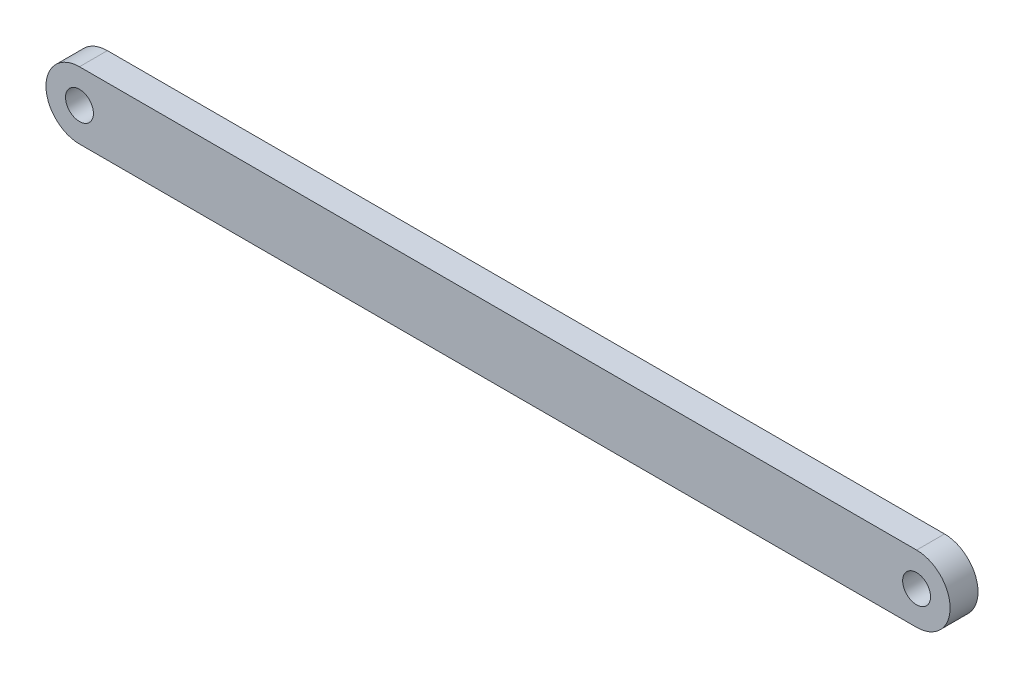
ISO-10303-21;
HEADER;
FILE_DESCRIPTION(('STEP AP214'),'2;1');
FILE_NAME('part.step','',(''),(''),'','','');
FILE_SCHEMA(('AUTOMOTIVE_DESIGN { 1 0 10303 214 1 1 1 1 }'));
ENDSEC;
DATA;
#1=APPLICATION_CONTEXT('core data for automotive mechanical design processes');
#2=APPLICATION_PROTOCOL_DEFINITION('international standard','automotive_design',2000,#1);
#3=PRODUCT_CONTEXT('',#1,'mechanical');
#4=PRODUCT('Part','Part','',(#3));
#5=PRODUCT_RELATED_PRODUCT_CATEGORY('part','',(#4));
#6=PRODUCT_DEFINITION_FORMATION('','',#4);
#7=PRODUCT_DEFINITION_CONTEXT('part definition',#1,'design');
#8=PRODUCT_DEFINITION('design','',#6,#7);
#9=PRODUCT_DEFINITION_SHAPE('','',#8);
#10=(LENGTH_UNIT() NAMED_UNIT(*) SI_UNIT(.MILLI.,.METRE.));
#11=(NAMED_UNIT(*) PLANE_ANGLE_UNIT() SI_UNIT($,.RADIAN.));
#12=(NAMED_UNIT(*) SI_UNIT($,.STERADIAN.) SOLID_ANGLE_UNIT());
#13=UNCERTAINTY_MEASURE_WITH_UNIT(LENGTH_MEASURE(1.E-05),#10,'distance_accuracy_value','');
#14=(GEOMETRIC_REPRESENTATION_CONTEXT(3) GLOBAL_UNCERTAINTY_ASSIGNED_CONTEXT((#13)) GLOBAL_UNIT_ASSIGNED_CONTEXT((#10,
#11,#12)) REPRESENTATION_CONTEXT('',''));
#15=CARTESIAN_POINT('',(0.,0.,0.));
#16=DIRECTION('',(0.,0.,1.));
#17=DIRECTION('',(1.,0.,0.));
#18=AXIS2_PLACEMENT_3D('',#15,#16,#17);
#19=CARTESIAN_POINT('',(-75.,0.,2.5));
#20=DIRECTION('',(0.,0.,1.));
#21=DIRECTION('',(1.,0.,0.));
#22=AXIS2_PLACEMENT_3D('',#19,#20,#21);
#23=PLANE('',#22);
#24=CARTESIAN_POINT('',(75.,0.,2.5));
#25=DIRECTION('',(0.,0.,1.));
#26=DIRECTION('',(1.,0.,0.));
#27=AXIS2_PLACEMENT_3D('',#24,#25,#26);
#28=CIRCLE('',#27,2.5);
#29=CARTESIAN_POINT('',(77.5,0.,2.5));
#30=VERTEX_POINT('',#29);
#31=EDGE_CURVE('E108',#30,#30,#28,.T.);
#32=ORIENTED_EDGE('',*,*,#31,.F.);
#33=EDGE_LOOP('',(#32));
#34=FACE_BOUND('',#33,.T.);
#35=CARTESIAN_POINT('',(-75.,0.,2.5));
#36=DIRECTION('',(0.,0.,1.));
#37=DIRECTION('',(1.,0.,0.));
#38=AXIS2_PLACEMENT_3D('',#35,#36,#37);
#39=CIRCLE('',#38,6.00000000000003);
#40=CARTESIAN_POINT('',(-75.,6.00000000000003,2.5));
#41=VERTEX_POINT('',#40);
#42=CARTESIAN_POINT('',(-75.,-6.00000000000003,2.5));
#43=VERTEX_POINT('',#42);
#44=EDGE_CURVE('E93',#41,#43,#39,.T.);
#45=ORIENTED_EDGE('',*,*,#44,.T.);
#46=DIRECTION('',(1.,0.,0.));
#47=VECTOR('',#46,1.);
#48=CARTESIAN_POINT('',(-75.,-6.00000000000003,2.5));
#49=LINE('',#48,#47);
#50=CARTESIAN_POINT('',(75.,-6.00000000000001,2.5));
#51=VERTEX_POINT('',#50);
#52=EDGE_CURVE('E88',#43,#51,#49,.T.);
#53=ORIENTED_EDGE('',*,*,#52,.T.);
#54=CARTESIAN_POINT('',(75.,0.,2.5));
#55=DIRECTION('',(0.,0.,1.));
#56=DIRECTION('',(1.,0.,0.));
#57=AXIS2_PLACEMENT_3D('',#54,#55,#56);
#58=CIRCLE('',#57,6.00000000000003);
#59=CARTESIAN_POINT('',(75.,6.00000000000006,2.5));
#60=VERTEX_POINT('',#59);
#61=EDGE_CURVE('E91',#51,#60,#58,.T.);
#62=ORIENTED_EDGE('',*,*,#61,.T.);
#63=DIRECTION('',(-1.,0.,0.));
#64=VECTOR('',#63,1.);
#65=CARTESIAN_POINT('',(-75.,6.00000000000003,2.5));
#66=LINE('',#65,#64);
#67=EDGE_CURVE('E58',#60,#41,#66,.T.);
#68=ORIENTED_EDGE('',*,*,#67,.T.);
#69=EDGE_LOOP('',(#45,#53,#62,#68));
#70=FACE_BOUND('',#69,.T.);
#71=CARTESIAN_POINT('',(-75.,0.,2.5));
#72=DIRECTION('',(0.,0.,1.));
#73=DIRECTION('',(1.,0.,0.));
#74=AXIS2_PLACEMENT_3D('',#71,#72,#73);
#75=CIRCLE('',#74,2.50000000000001);
#76=CARTESIAN_POINT('',(-72.5,0.,2.5));
#77=VERTEX_POINT('',#76);
#78=EDGE_CURVE('E123',#77,#77,#75,.T.);
#79=ORIENTED_EDGE('',*,*,#78,.F.);
#80=EDGE_LOOP('',(#79));
#81=FACE_BOUND('',#80,.T.);
#82=ADVANCED_FACE('F41',(#34,#70,#81),#23,.T.);
#83=CARTESIAN_POINT('',(-75.,0.,-2.5));
#84=DIRECTION('',(0.,0.,1.));
#85=DIRECTION('',(1.,0.,0.));
#86=AXIS2_PLACEMENT_3D('',#83,#84,#85);
#87=PLANE('',#86);
#88=CARTESIAN_POINT('',(-75.,0.,-2.5));
#89=DIRECTION('',(0.,0.,1.));
#90=DIRECTION('',(1.,0.,0.));
#91=AXIS2_PLACEMENT_3D('',#88,#89,#90);
#92=CIRCLE('',#91,6.00000000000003);
#93=CARTESIAN_POINT('',(-75.,6.00000000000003,-2.5));
#94=VERTEX_POINT('',#93);
#95=CARTESIAN_POINT('',(-75.,-6.00000000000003,-2.5));
#96=VERTEX_POINT('',#95);
#97=EDGE_CURVE('E105',#94,#96,#92,.T.);
#98=ORIENTED_EDGE('',*,*,#97,.F.);
#99=DIRECTION('',(-1.,0.,0.));
#100=VECTOR('',#99,1.);
#101=CARTESIAN_POINT('',(-75.,6.00000000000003,-2.5));
#102=LINE('',#101,#100);
#103=CARTESIAN_POINT('',(75.,6.00000000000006,-2.5));
#104=VERTEX_POINT('',#103);
#105=EDGE_CURVE('E81',#104,#94,#102,.T.);
#106=ORIENTED_EDGE('',*,*,#105,.F.);
#107=CARTESIAN_POINT('',(75.,0.,-2.5));
#108=DIRECTION('',(0.,0.,1.));
#109=DIRECTION('',(1.,0.,0.));
#110=AXIS2_PLACEMENT_3D('',#107,#108,#109);
#111=CIRCLE('',#110,6.00000000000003);
#112=CARTESIAN_POINT('',(75.,-6.00000000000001,-2.5));
#113=VERTEX_POINT('',#112);
#114=EDGE_CURVE('E75',#113,#104,#111,.T.);
#115=ORIENTED_EDGE('',*,*,#114,.F.);
#116=DIRECTION('',(1.,0.,0.));
#117=VECTOR('',#116,1.);
#118=CARTESIAN_POINT('',(-75.,-6.00000000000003,-2.5));
#119=LINE('',#118,#117);
#120=EDGE_CURVE('E97',#96,#113,#119,.T.);
#121=ORIENTED_EDGE('',*,*,#120,.F.);
#122=EDGE_LOOP('',(#98,#106,#115,#121));
#123=FACE_BOUND('',#122,.T.);
#124=CARTESIAN_POINT('',(75.,0.,-2.5));
#125=DIRECTION('',(0.,0.,1.));
#126=DIRECTION('',(1.,0.,0.));
#127=AXIS2_PLACEMENT_3D('',#124,#125,#126);
#128=CIRCLE('',#127,2.5);
#129=CARTESIAN_POINT('',(77.5,0.,-2.5));
#130=VERTEX_POINT('',#129);
#131=EDGE_CURVE('E120',#130,#130,#128,.T.);
#132=ORIENTED_EDGE('',*,*,#131,.T.);
#133=EDGE_LOOP('',(#132));
#134=FACE_BOUND('',#133,.T.);
#135=CARTESIAN_POINT('',(-75.,0.,-2.5));
#136=DIRECTION('',(0.,0.,1.));
#137=DIRECTION('',(1.,0.,0.));
#138=AXIS2_PLACEMENT_3D('',#135,#136,#137);
#139=CIRCLE('',#138,2.50000000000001);
#140=CARTESIAN_POINT('',(-72.5,0.,-2.5));
#141=VERTEX_POINT('',#140);
#142=EDGE_CURVE('E126',#141,#141,#139,.T.);
#143=ORIENTED_EDGE('',*,*,#142,.T.);
#144=EDGE_LOOP('',(#143));
#145=FACE_BOUND('',#144,.T.);
#146=ADVANCED_FACE('F116',(#123,#134,#145),#87,.F.);
#147=CARTESIAN_POINT('',(-75.,0.,2.5));
#148=DIRECTION('',(0.,0.,-1.));
#149=DIRECTION('',(-1.,0.,0.));
#150=AXIS2_PLACEMENT_3D('',#147,#148,#149);
#151=CYLINDRICAL_SURFACE('',#150,6.00000000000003);
#152=ORIENTED_EDGE('',*,*,#97,.T.);
#153=DIRECTION('',(0.,0.,-1.));
#154=VECTOR('',#153,1.);
#155=CARTESIAN_POINT('',(-75.,-6.00000000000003,2.5));
#156=LINE('',#155,#154);
#157=EDGE_CURVE('E11',#43,#96,#156,.T.);
#158=ORIENTED_EDGE('',*,*,#157,.F.);
#159=ORIENTED_EDGE('',*,*,#44,.F.);
#160=DIRECTION('',(0.,0.,-1.));
#161=VECTOR('',#160,1.);
#162=CARTESIAN_POINT('',(-75.,6.00000000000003,2.5));
#163=LINE('',#162,#161);
#164=EDGE_CURVE('E101',#41,#94,#163,.T.);
#165=ORIENTED_EDGE('',*,*,#164,.T.);
#166=EDGE_LOOP('',(#152,#158,#159,#165));
#167=FACE_BOUND('',#166,.T.);
#168=ADVANCED_FACE('F43',(#167),#151,.T.);
#169=CARTESIAN_POINT('',(-75.,-6.00000000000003,2.5));
#170=DIRECTION('',(0.,1.,0.));
#171=DIRECTION('',(-1.,0.,0.));
#172=AXIS2_PLACEMENT_3D('',#169,#170,#171);
#173=PLANE('',#172);
#174=ORIENTED_EDGE('',*,*,#120,.T.);
#175=DIRECTION('',(0.,0.,-1.));
#176=VECTOR('',#175,1.);
#177=CARTESIAN_POINT('',(75.,-6.00000000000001,2.5));
#178=LINE('',#177,#176);
#179=EDGE_CURVE('E50',#51,#113,#178,.T.);
#180=ORIENTED_EDGE('',*,*,#179,.F.);
#181=ORIENTED_EDGE('',*,*,#52,.F.);
#182=ORIENTED_EDGE('',*,*,#157,.T.);
#183=EDGE_LOOP('',(#174,#180,#181,#182));
#184=FACE_BOUND('',#183,.T.);
#185=ADVANCED_FACE('F96',(#184),#173,.F.);
#186=CARTESIAN_POINT('',(75.,0.,2.5));
#187=DIRECTION('',(0.,0.,-1.));
#188=DIRECTION('',(-1.,0.,0.));
#189=AXIS2_PLACEMENT_3D('',#186,#187,#188);
#190=CYLINDRICAL_SURFACE('',#189,6.00000000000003);
#191=ORIENTED_EDGE('',*,*,#114,.T.);
#192=DIRECTION('',(0.,0.,-1.));
#193=VECTOR('',#192,1.);
#194=CARTESIAN_POINT('',(75.,6.00000000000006,2.5));
#195=LINE('',#194,#193);
#196=EDGE_CURVE('E98',#60,#104,#195,.T.);
#197=ORIENTED_EDGE('',*,*,#196,.F.);
#198=ORIENTED_EDGE('',*,*,#61,.F.);
#199=ORIENTED_EDGE('',*,*,#179,.T.);
#200=EDGE_LOOP('',(#191,#197,#198,#199));
#201=FACE_BOUND('',#200,.T.);
#202=ADVANCED_FACE('F99',(#201),#190,.T.);
#203=CARTESIAN_POINT('',(-75.,6.00000000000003,2.5));
#204=DIRECTION('',(0.,-1.,0.));
#205=DIRECTION('',(1.,0.,0.));
#206=AXIS2_PLACEMENT_3D('',#203,#204,#205);
#207=PLANE('',#206);
#208=ORIENTED_EDGE('',*,*,#105,.T.);
#209=ORIENTED_EDGE('',*,*,#164,.F.);
#210=ORIENTED_EDGE('',*,*,#67,.F.);
#211=ORIENTED_EDGE('',*,*,#196,.T.);
#212=EDGE_LOOP('',(#208,#209,#210,#211));
#213=FACE_BOUND('',#212,.T.);
#214=ADVANCED_FACE('F113',(#213),#207,.F.);
#215=CARTESIAN_POINT('',(75.,0.,2.5));
#216=DIRECTION('',(0.,0.,-1.));
#217=DIRECTION('',(-1.,0.,0.));
#218=AXIS2_PLACEMENT_3D('',#215,#216,#217);
#219=CYLINDRICAL_SURFACE('',#218,2.5);
#220=ORIENTED_EDGE('',*,*,#31,.T.);
#221=EDGE_LOOP('',(#220));
#222=FACE_BOUND('',#221,.T.);
#223=ORIENTED_EDGE('',*,*,#131,.F.);
#224=EDGE_LOOP('',(#223));
#225=FACE_BOUND('',#224,.T.);
#226=ADVANCED_FACE('F143',(#222,#225),#219,.F.);
#227=CARTESIAN_POINT('',(-75.,0.,2.5));
#228=DIRECTION('',(0.,0.,-1.));
#229=DIRECTION('',(-1.,0.,0.));
#230=AXIS2_PLACEMENT_3D('',#227,#228,#229);
#231=CYLINDRICAL_SURFACE('',#230,2.50000000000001);
#232=ORIENTED_EDGE('',*,*,#78,.T.);
#233=EDGE_LOOP('',(#232));
#234=FACE_BOUND('',#233,.T.);
#235=ORIENTED_EDGE('',*,*,#142,.F.);
#236=EDGE_LOOP('',(#235));
#237=FACE_BOUND('',#236,.T.);
#238=ADVANCED_FACE('F132',(#234,#237),#231,.F.);
#239=CLOSED_SHELL('',(#82,#146,#168,#185,#202,#214,#226,#238));
#240=MANIFOLD_SOLID_BREP('B2',#239);
#241=ADVANCED_BREP_SHAPE_REPRESENTATION('',(#18,#240),#14);
#242=SHAPE_DEFINITION_REPRESENTATION(#9,#241);
ENDSEC;
END-ISO-10303-21;
